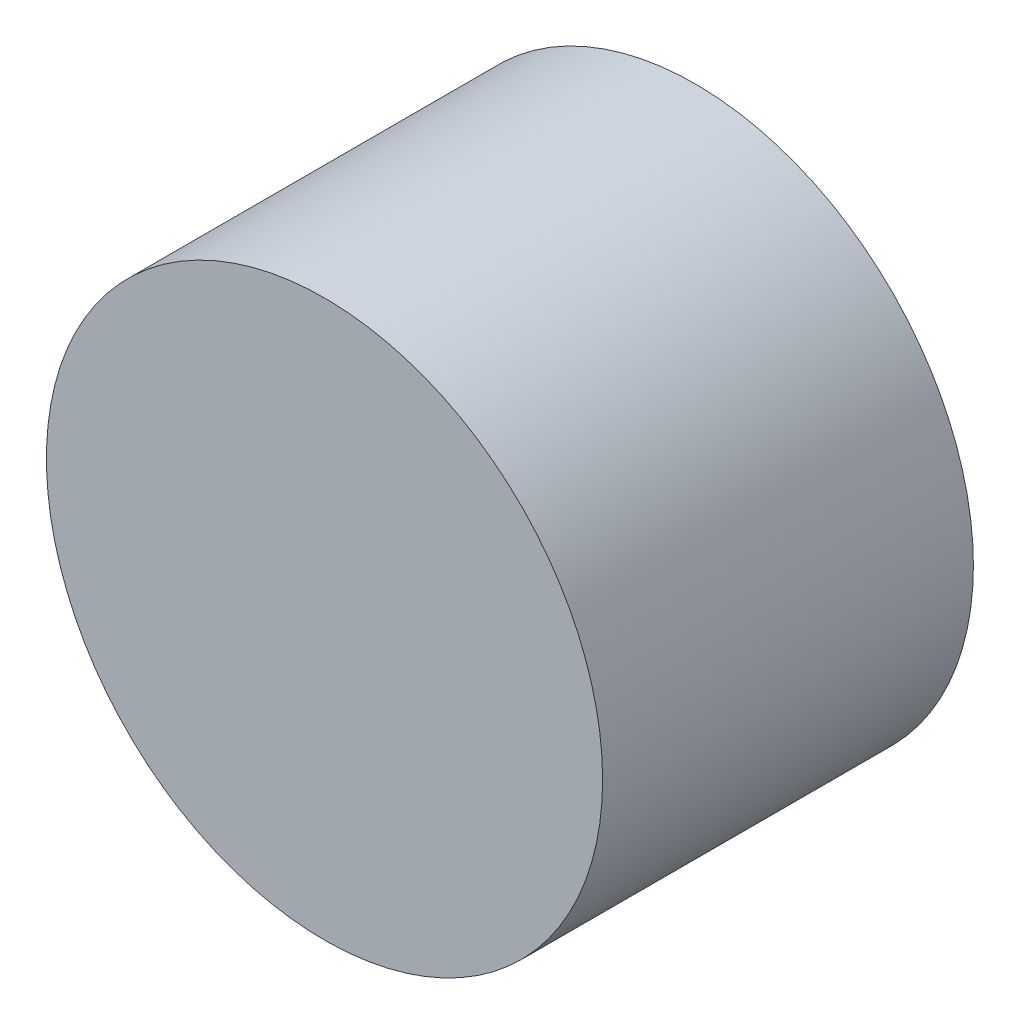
ISO-10303-21;
HEADER;
FILE_DESCRIPTION(('STEP AP214'),'2;1');
FILE_NAME('part.step','',(''),(''),'','','');
FILE_SCHEMA(('AUTOMOTIVE_DESIGN { 1 0 10303 214 1 1 1 1 }'));
ENDSEC;
DATA;
#1=APPLICATION_CONTEXT('core data for automotive mechanical design processes');
#2=APPLICATION_PROTOCOL_DEFINITION('international standard','automotive_design',2000,#1);
#3=PRODUCT_CONTEXT('',#1,'mechanical');
#4=PRODUCT('Part','Part','',(#3));
#5=PRODUCT_RELATED_PRODUCT_CATEGORY('part','',(#4));
#6=PRODUCT_DEFINITION_FORMATION('','',#4);
#7=PRODUCT_DEFINITION_CONTEXT('part definition',#1,'design');
#8=PRODUCT_DEFINITION('design','',#6,#7);
#9=PRODUCT_DEFINITION_SHAPE('','',#8);
#10=(LENGTH_UNIT() NAMED_UNIT(*) SI_UNIT(.MILLI.,.METRE.));
#11=(NAMED_UNIT(*) PLANE_ANGLE_UNIT() SI_UNIT($,.RADIAN.));
#12=(NAMED_UNIT(*) SI_UNIT($,.STERADIAN.) SOLID_ANGLE_UNIT());
#13=UNCERTAINTY_MEASURE_WITH_UNIT(LENGTH_MEASURE(1.E-05),#10,'distance_accuracy_value','');
#14=(GEOMETRIC_REPRESENTATION_CONTEXT(3) GLOBAL_UNCERTAINTY_ASSIGNED_CONTEXT((#13)) GLOBAL_UNIT_ASSIGNED_CONTEXT((#10,
#11,#12)) REPRESENTATION_CONTEXT('',''));
#15=CARTESIAN_POINT('',(0.,0.,0.));
#16=DIRECTION('',(0.,0.,1.));
#17=DIRECTION('',(1.,0.,0.));
#18=AXIS2_PLACEMENT_3D('',#15,#16,#17);
#19=CARTESIAN_POINT('',(0.,0.,25.4));
#20=DIRECTION('',(0.,0.,-1.));
#21=DIRECTION('',(-1.,0.,0.));
#22=AXIS2_PLACEMENT_3D('',#19,#20,#21);
#23=CYLINDRICAL_SURFACE('',#22,38.1);
#24=CARTESIAN_POINT('',(0.,0.,25.4));
#25=DIRECTION('',(0.,0.,1.));
#26=DIRECTION('',(1.,0.,0.));
#27=AXIS2_PLACEMENT_3D('',#24,#25,#26);
#28=CIRCLE('',#27,38.1);
#29=CARTESIAN_POINT('',(38.1,0.,25.4));
#30=VERTEX_POINT('',#29);
#31=EDGE_CURVE('E12',#30,#30,#28,.T.);
#32=ORIENTED_EDGE('',*,*,#31,.F.);
#33=EDGE_LOOP('',(#32));
#34=FACE_BOUND('',#33,.T.);
#35=CARTESIAN_POINT('',(0.,0.,-25.4));
#36=DIRECTION('',(0.,0.,1.));
#37=DIRECTION('',(1.,0.,0.));
#38=AXIS2_PLACEMENT_3D('',#35,#36,#37);
#39=CIRCLE('',#38,38.1);
#40=CARTESIAN_POINT('',(38.1,0.,-25.4));
#41=VERTEX_POINT('',#40);
#42=EDGE_CURVE('E43',#41,#41,#39,.T.);
#43=ORIENTED_EDGE('',*,*,#42,.T.);
#44=EDGE_LOOP('',(#43));
#45=FACE_BOUND('',#44,.T.);
#46=ADVANCED_FACE('F40',(#34,#45),#23,.T.);
#47=CARTESIAN_POINT('',(0.,0.,25.4));
#48=DIRECTION('',(0.,0.,1.));
#49=DIRECTION('',(1.,0.,0.));
#50=AXIS2_PLACEMENT_3D('',#47,#48,#49);
#51=PLANE('',#50);
#52=ORIENTED_EDGE('',*,*,#31,.T.);
#53=EDGE_LOOP('',(#52));
#54=FACE_BOUND('',#53,.T.);
#55=ADVANCED_FACE('F55',(#54),#51,.T.);
#56=CARTESIAN_POINT('',(0.,0.,-25.4));
#57=DIRECTION('',(0.,0.,1.));
#58=DIRECTION('',(1.,0.,0.));
#59=AXIS2_PLACEMENT_3D('',#56,#57,#58);
#60=PLANE('',#59);
#61=ORIENTED_EDGE('',*,*,#42,.F.);
#62=EDGE_LOOP('',(#61));
#63=FACE_BOUND('',#62,.T.);
#64=ADVANCED_FACE('F53',(#63),#60,.F.);
#65=CLOSED_SHELL('',(#46,#55,#64));
#66=MANIFOLD_SOLID_BREP('B2',#65);
#67=ADVANCED_BREP_SHAPE_REPRESENTATION('',(#18,#66),#14);
#68=SHAPE_DEFINITION_REPRESENTATION(#9,#67);
ENDSEC;
END-ISO-10303-21;
